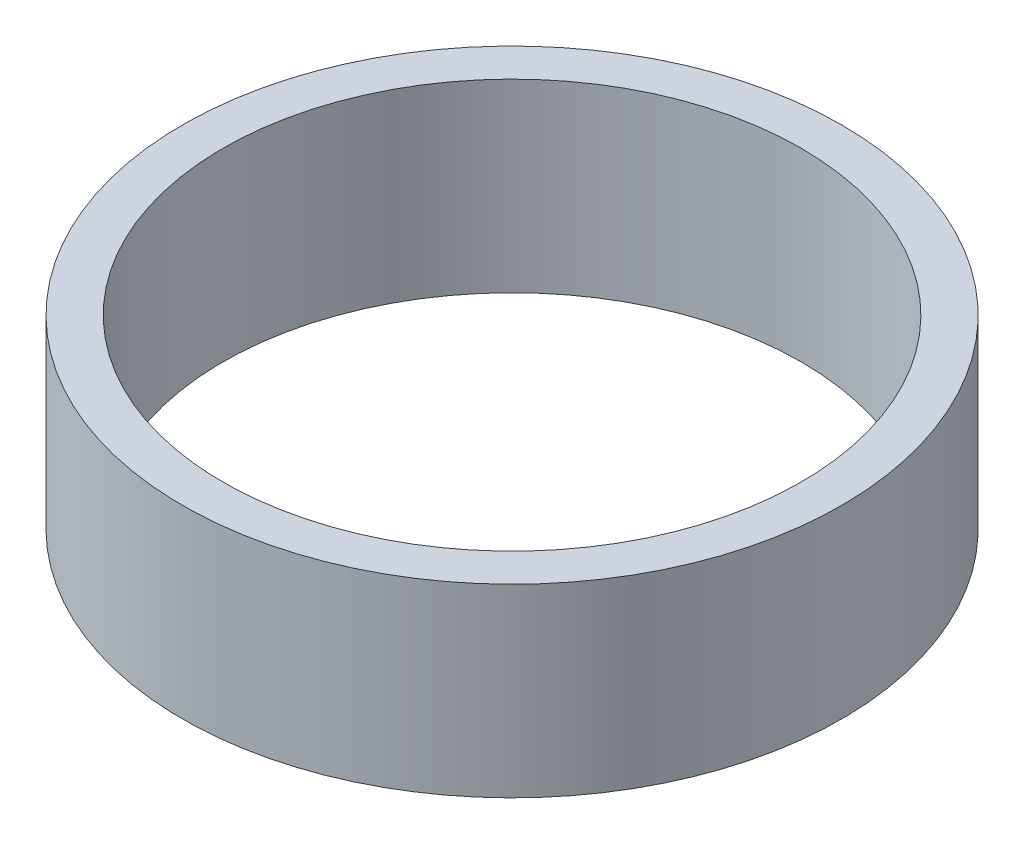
from build123d import *

# Parameters (mm, degrees)
ESQUISSE1_W = 1.75
ESQUISSE1_H = 8


with BuildPart() as part:
    # Esquisse1 → R_volution1 (revolve)
    with BuildSketch(Plane.XY, mode=Mode.PRIVATE) as r_volution1_sk:
        with Locations((13.375, 4)):
            Rectangle(ESQUISSE1_W, ESQUISSE1_H)
    revolve(r_volution1_sk.sketch.rotate(Axis((0, 0, 0), (0, 1, 0)), 90), axis=Axis((0, 0, 0), (0, 1, 0)))


solid = part.part
